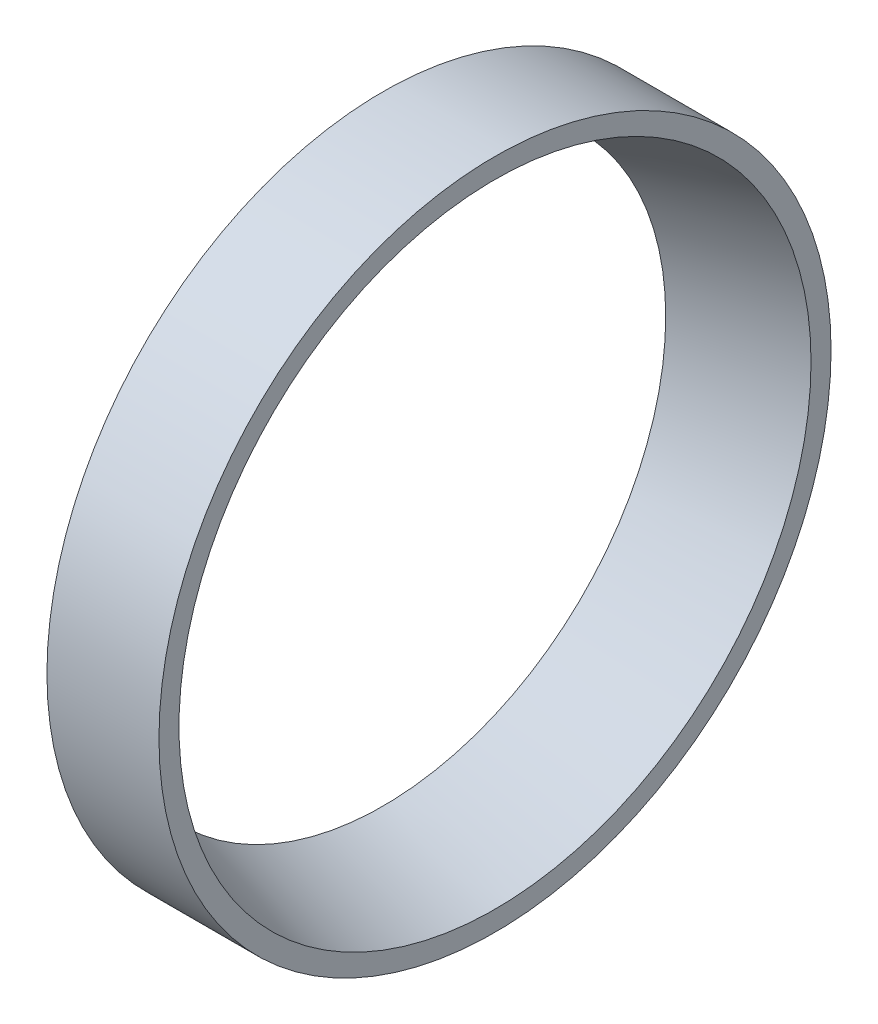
ISO-10303-21;
HEADER;
FILE_DESCRIPTION(('STEP AP214'),'2;1');
FILE_NAME('part.step','',(''),(''),'','','');
FILE_SCHEMA(('AUTOMOTIVE_DESIGN { 1 0 10303 214 1 1 1 1 }'));
ENDSEC;
DATA;
#1=APPLICATION_CONTEXT('core data for automotive mechanical design processes');
#2=APPLICATION_PROTOCOL_DEFINITION('international standard','automotive_design',2000,#1);
#3=PRODUCT_CONTEXT('',#1,'mechanical');
#4=PRODUCT('Part','Part','',(#3));
#5=PRODUCT_RELATED_PRODUCT_CATEGORY('part','',(#4));
#6=PRODUCT_DEFINITION_FORMATION('','',#4);
#7=PRODUCT_DEFINITION_CONTEXT('part definition',#1,'design');
#8=PRODUCT_DEFINITION('design','',#6,#7);
#9=PRODUCT_DEFINITION_SHAPE('','',#8);
#10=(LENGTH_UNIT() NAMED_UNIT(*) SI_UNIT(.MILLI.,.METRE.));
#11=(NAMED_UNIT(*) PLANE_ANGLE_UNIT() SI_UNIT($,.RADIAN.));
#12=(NAMED_UNIT(*) SI_UNIT($,.STERADIAN.) SOLID_ANGLE_UNIT());
#13=UNCERTAINTY_MEASURE_WITH_UNIT(LENGTH_MEASURE(1.E-05),#10,'distance_accuracy_value','');
#14=(GEOMETRIC_REPRESENTATION_CONTEXT(3) GLOBAL_UNCERTAINTY_ASSIGNED_CONTEXT((#13)) GLOBAL_UNIT_ASSIGNED_CONTEXT((#10,
#11,#12)) REPRESENTATION_CONTEXT('',''));
#15=CARTESIAN_POINT('',(0.,0.,0.));
#16=DIRECTION('',(0.,0.,1.));
#17=DIRECTION('',(1.,0.,0.));
#18=AXIS2_PLACEMENT_3D('',#15,#16,#17);
#19=CARTESIAN_POINT('',(-10.,0.,0.));
#20=DIRECTION('',(1.,0.,0.));
#21=DIRECTION('',(0.,0.,-1.));
#22=AXIS2_PLACEMENT_3D('',#19,#20,#21);
#23=CONICAL_SURFACE('',#22,25.24,0.288886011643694);
#24=CARTESIAN_POINT('',(0.,0.,0.));
#25=DIRECTION('',(1.,0.,0.));
#26=DIRECTION('',(0.,0.,-1.));
#27=AXIS2_PLACEMENT_3D('',#24,#25,#26);
#28=CIRCLE('',#27,28.212);
#29=CARTESIAN_POINT('',(0.,0.,-28.212));
#30=VERTEX_POINT('',#29);
#31=EDGE_CURVE('E10',#30,#30,#28,.T.);
#32=ORIENTED_EDGE('',*,*,#31,.T.);
#33=EDGE_LOOP('',(#32));
#34=FACE_BOUND('',#33,.T.);
#35=CARTESIAN_POINT('',(-10.,0.,0.));
#36=DIRECTION('',(1.,0.,0.));
#37=DIRECTION('',(0.,0.,-1.));
#38=AXIS2_PLACEMENT_3D('',#35,#36,#37);
#39=CIRCLE('',#38,25.24);
#40=CARTESIAN_POINT('',(-10.,0.,-25.24));
#41=VERTEX_POINT('',#40);
#42=EDGE_CURVE('E36',#41,#41,#39,.T.);
#43=ORIENTED_EDGE('',*,*,#42,.F.);
#44=EDGE_LOOP('',(#43));
#45=FACE_BOUND('',#44,.T.);
#46=ADVANCED_FACE('F22',(#34,#45),#23,.F.);
#47=CARTESIAN_POINT('',(0.,28.212,0.));
#48=DIRECTION('',(1.,0.,0.));
#49=DIRECTION('',(0.,0.,-1.));
#50=AXIS2_PLACEMENT_3D('',#47,#48,#49);
#51=PLANE('',#50);
#52=CARTESIAN_POINT('',(0.,0.,0.));
#53=DIRECTION('',(1.,0.,0.));
#54=DIRECTION('',(0.,0.,-1.));
#55=AXIS2_PLACEMENT_3D('',#52,#53,#54);
#56=CIRCLE('',#55,30.);
#57=CARTESIAN_POINT('',(0.,0.,-30.));
#58=VERTEX_POINT('',#57);
#59=EDGE_CURVE('E28',#58,#58,#56,.T.);
#60=ORIENTED_EDGE('',*,*,#59,.T.);
#61=EDGE_LOOP('',(#60));
#62=FACE_BOUND('',#61,.T.);
#63=ORIENTED_EDGE('',*,*,#31,.F.);
#64=EDGE_LOOP('',(#63));
#65=FACE_BOUND('',#64,.T.);
#66=ADVANCED_FACE('F46',(#62,#65),#51,.T.);
#67=CARTESIAN_POINT('',(40.,0.,0.));
#68=DIRECTION('',(1.,0.,0.));
#69=DIRECTION('',(0.,0.,-1.));
#70=AXIS2_PLACEMENT_3D('',#67,#68,#69);
#71=CYLINDRICAL_SURFACE('',#70,30.);
#72=CARTESIAN_POINT('',(-10.,0.,0.));
#73=DIRECTION('',(1.,0.,0.));
#74=DIRECTION('',(0.,0.,-1.));
#75=AXIS2_PLACEMENT_3D('',#72,#73,#74);
#76=CIRCLE('',#75,30.);
#77=CARTESIAN_POINT('',(-10.,0.,-30.));
#78=VERTEX_POINT('',#77);
#79=EDGE_CURVE('E32',#78,#78,#76,.T.);
#80=ORIENTED_EDGE('',*,*,#79,.T.);
#81=EDGE_LOOP('',(#80));
#82=FACE_BOUND('',#81,.T.);
#83=ORIENTED_EDGE('',*,*,#59,.F.);
#84=EDGE_LOOP('',(#83));
#85=FACE_BOUND('',#84,.T.);
#86=ADVANCED_FACE('F50',(#82,#85),#71,.T.);
#87=CARTESIAN_POINT('',(-10.,30.,0.));
#88=DIRECTION('',(-1.,0.,0.));
#89=DIRECTION('',(0.,0.,1.));
#90=AXIS2_PLACEMENT_3D('',#87,#88,#89);
#91=PLANE('',#90);
#92=ORIENTED_EDGE('',*,*,#42,.T.);
#93=EDGE_LOOP('',(#92));
#94=FACE_BOUND('',#93,.T.);
#95=ORIENTED_EDGE('',*,*,#79,.F.);
#96=EDGE_LOOP('',(#95));
#97=FACE_BOUND('',#96,.T.);
#98=ADVANCED_FACE('F42',(#94,#97),#91,.T.);
#99=CLOSED_SHELL('',(#46,#66,#86,#98));
#100=MANIFOLD_SOLID_BREP('B2',#99);
#101=ADVANCED_BREP_SHAPE_REPRESENTATION('',(#18,#100),#14);
#102=SHAPE_DEFINITION_REPRESENTATION(#9,#101);
ENDSEC;
END-ISO-10303-21;
